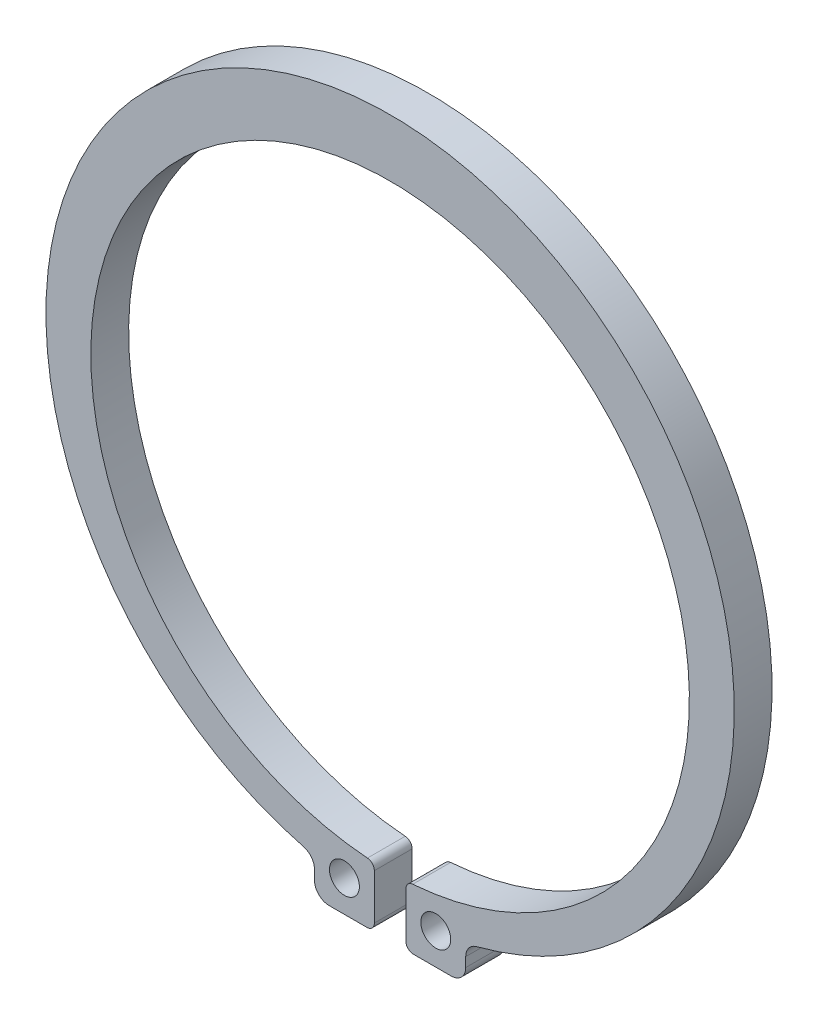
ISO-10303-21;
HEADER;
FILE_DESCRIPTION(('STEP AP214'),'2;1');
FILE_NAME('part.step','',(''),(''),'','','');
FILE_SCHEMA(('AUTOMOTIVE_DESIGN { 1 0 10303 214 1 1 1 1 }'));
ENDSEC;
DATA;
#1=APPLICATION_CONTEXT('core data for automotive mechanical design processes');
#2=APPLICATION_PROTOCOL_DEFINITION('international standard','automotive_design',2000,#1);
#3=PRODUCT_CONTEXT('',#1,'mechanical');
#4=PRODUCT('Part','Part','',(#3));
#5=PRODUCT_RELATED_PRODUCT_CATEGORY('part','',(#4));
#6=PRODUCT_DEFINITION_FORMATION('','',#4);
#7=PRODUCT_DEFINITION_CONTEXT('part definition',#1,'design');
#8=PRODUCT_DEFINITION('design','',#6,#7);
#9=PRODUCT_DEFINITION_SHAPE('','',#8);
#10=(LENGTH_UNIT() NAMED_UNIT(*) SI_UNIT(.MILLI.,.METRE.));
#11=(NAMED_UNIT(*) PLANE_ANGLE_UNIT() SI_UNIT($,.RADIAN.));
#12=(NAMED_UNIT(*) SI_UNIT($,.STERADIAN.) SOLID_ANGLE_UNIT());
#13=UNCERTAINTY_MEASURE_WITH_UNIT(LENGTH_MEASURE(1.E-05),#10,'distance_accuracy_value','');
#14=(GEOMETRIC_REPRESENTATION_CONTEXT(3) GLOBAL_UNCERTAINTY_ASSIGNED_CONTEXT((#13)) GLOBAL_UNIT_ASSIGNED_CONTEXT((#10,
#11,#12)) REPRESENTATION_CONTEXT('',''));
#15=CARTESIAN_POINT('',(0.,0.,0.));
#16=DIRECTION('',(0.,0.,1.));
#17=DIRECTION('',(1.,0.,0.));
#18=AXIS2_PLACEMENT_3D('',#15,#16,#17);
#19=CARTESIAN_POINT('',(0.,0.,1.20000000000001));
#20=DIRECTION('',(0.,0.,1.));
#21=DIRECTION('',(1.,0.,0.));
#22=AXIS2_PLACEMENT_3D('',#19,#20,#21);
#23=PLANE('',#22);
#24=DIRECTION('',(-1.,0.,0.));
#25=VECTOR('',#24,1.);
#26=CARTESIAN_POINT('',(-0.499999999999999,-11.7868329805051,1.20000000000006));
#27=LINE('',#26,#25);
#28=CARTESIAN_POINT('',(-0.737499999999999,-11.7868329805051,1.20000000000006));
#29=VERTEX_POINT('',#28);
#30=CARTESIAN_POINT('',(-1.93658536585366,-11.7868329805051,1.20000000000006));
#31=VERTEX_POINT('',#30);
#32=EDGE_CURVE('E176',#29,#31,#27,.T.);
#33=ORIENTED_EDGE('',*,*,#32,.F.);
#34=CARTESIAN_POINT('',(-0.737499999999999,-11.5493329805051,1.20000000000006));
#35=DIRECTION('',(0.,0.,1.));
#36=DIRECTION('',(1.,0.,0.));
#37=AXIS2_PLACEMENT_3D('',#34,#35,#36);
#38=CIRCLE('',#37,0.2375);
#39=CARTESIAN_POINT('',(-0.499999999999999,-11.5493329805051,1.20000000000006));
#40=VERTEX_POINT('',#39);
#41=EDGE_CURVE('E243',#29,#40,#38,.T.);
#42=ORIENTED_EDGE('',*,*,#41,.T.);
#43=DIRECTION('',(0.,-1.,0.));
#44=VECTOR('',#43,1.);
#45=CARTESIAN_POINT('',(-0.499999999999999,-9.88683298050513,1.20000000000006));
#46=LINE('',#45,#44);
#47=CARTESIAN_POINT('',(-0.499999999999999,-10.1095313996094,1.20000000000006));
#48=VERTEX_POINT('',#47);
#49=EDGE_CURVE('E190',#48,#40,#46,.T.);
#50=ORIENTED_EDGE('',*,*,#49,.F.);
#51=CARTESIAN_POINT('',(-0.737499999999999,-10.1095313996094,1.20000000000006));
#52=DIRECTION('',(0.,0.,1.));
#53=DIRECTION('',(1.,0.,0.));
#54=AXIS2_PLACEMENT_3D('',#51,#52,#53);
#55=CIRCLE('',#54,0.2375);
#56=CARTESIAN_POINT('',(-0.71951219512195,-9.87271356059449,1.20000000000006));
#57=VERTEX_POINT('',#56);
#58=EDGE_CURVE('E239',#48,#57,#55,.T.);
#59=ORIENTED_EDGE('',*,*,#58,.T.);
#60=CARTESIAN_POINT('',(0.,-0.400000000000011,1.20000000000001));
#61=DIRECTION('',(0.,0.,1.));
#62=DIRECTION('',(1.,0.,0.));
#63=AXIS2_PLACEMENT_3D('',#60,#61,#62);
#64=CIRCLE('',#63,9.5);
#65=CARTESIAN_POINT('',(0.719512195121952,-9.87271356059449,1.20000000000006));
#66=VERTEX_POINT('',#65);
#67=EDGE_CURVE('E199',#66,#57,#64,.T.);
#68=ORIENTED_EDGE('',*,*,#67,.F.);
#69=CARTESIAN_POINT('',(0.737500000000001,-10.1095313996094,1.20000000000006));
#70=DIRECTION('',(0.,0.,1.));
#71=DIRECTION('',(1.,0.,0.));
#72=AXIS2_PLACEMENT_3D('',#69,#70,#71);
#73=CIRCLE('',#72,0.2375);
#74=CARTESIAN_POINT('',(0.500000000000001,-10.1095313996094,1.20000000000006));
#75=VERTEX_POINT('',#74);
#76=EDGE_CURVE('E237',#66,#75,#73,.T.);
#77=ORIENTED_EDGE('',*,*,#76,.T.);
#78=DIRECTION('',(0.,-1.,0.));
#79=VECTOR('',#78,1.);
#80=CARTESIAN_POINT('',(0.500000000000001,-9.88683298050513,1.20000000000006));
#81=LINE('',#80,#79);
#82=CARTESIAN_POINT('',(0.500000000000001,-11.5493329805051,1.20000000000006));
#83=VERTEX_POINT('',#82);
#84=EDGE_CURVE('E187',#75,#83,#81,.T.);
#85=ORIENTED_EDGE('',*,*,#84,.T.);
#86=CARTESIAN_POINT('',(0.737500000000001,-11.5493329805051,1.20000000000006));
#87=DIRECTION('',(0.,0.,1.));
#88=DIRECTION('',(1.,0.,0.));
#89=AXIS2_PLACEMENT_3D('',#86,#87,#88);
#90=CIRCLE('',#89,0.2375);
#91=CARTESIAN_POINT('',(0.737500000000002,-11.7868329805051,1.20000000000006));
#92=VERTEX_POINT('',#91);
#93=EDGE_CURVE('E241',#83,#92,#90,.T.);
#94=ORIENTED_EDGE('',*,*,#93,.T.);
#95=DIRECTION('',(1.,0.,0.));
#96=VECTOR('',#95,1.);
#97=CARTESIAN_POINT('',(0.500000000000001,-11.7868329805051,1.20000000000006));
#98=LINE('',#97,#96);
#99=CARTESIAN_POINT('',(1.93658536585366,-11.7868329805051,1.20000000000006));
#100=VERTEX_POINT('',#99);
#101=EDGE_CURVE('E354',#92,#100,#98,.T.);
#102=ORIENTED_EDGE('',*,*,#101,.T.);
#103=CARTESIAN_POINT('',(1.93658536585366,-11.3234183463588,1.20000000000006));
#104=DIRECTION('',(0.,0.,1.));
#105=DIRECTION('',(1.,0.,0.));
#106=AXIS2_PLACEMENT_3D('',#103,#104,#105);
#107=CIRCLE('',#106,0.463414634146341);
#108=CARTESIAN_POINT('',(2.4,-11.3234183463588,1.20000000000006));
#109=VERTEX_POINT('',#108);
#110=EDGE_CURVE('E158',#100,#109,#107,.T.);
#111=ORIENTED_EDGE('',*,*,#110,.T.);
#112=DIRECTION('',(0.,1.,0.));
#113=VECTOR('',#112,1.);
#114=CARTESIAN_POINT('',(2.4,-11.7868329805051,1.20000000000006));
#115=LINE('',#114,#113);
#116=CARTESIAN_POINT('',(2.4,-11.0225607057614,1.20000000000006));
#117=VERTEX_POINT('',#116);
#118=EDGE_CURVE('E345',#109,#117,#115,.T.);
#119=ORIENTED_EDGE('',*,*,#118,.T.);
#120=CARTESIAN_POINT('',(2.86341463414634,-11.0225607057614,1.20000000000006));
#121=DIRECTION('',(0.,0.,1.));
#122=DIRECTION('',(1.,0.,0.));
#123=AXIS2_PLACEMENT_3D('',#120,#121,#122);
#124=CIRCLE('',#123,0.463414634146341);
#125=CARTESIAN_POINT('',(2.74689725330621,-10.5740333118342,1.20000000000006));
#126=VERTEX_POINT('',#125);
#127=EDGE_CURVE('E232',#117,#126,#124,.F.);
#128=ORIENTED_EDGE('',*,*,#127,.T.);
#129=CARTESIAN_POINT('',(0.,0.,1.20000000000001));
#130=DIRECTION('',(0.,0.,1.));
#131=DIRECTION('',(1.,0.,0.));
#132=AXIS2_PLACEMENT_3D('',#129,#130,#131);
#133=CIRCLE('',#132,10.925);
#134=CARTESIAN_POINT('',(-2.7468972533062,-10.5740333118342,1.20000000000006));
#135=VERTEX_POINT('',#134);
#136=EDGE_CURVE('E170',#126,#135,#133,.T.);
#137=ORIENTED_EDGE('',*,*,#136,.T.);
#138=CARTESIAN_POINT('',(-2.86341463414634,-11.0225607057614,1.20000000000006));
#139=DIRECTION('',(0.,0.,1.));
#140=DIRECTION('',(1.,0.,0.));
#141=AXIS2_PLACEMENT_3D('',#138,#139,#140);
#142=CIRCLE('',#141,0.463414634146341);
#143=CARTESIAN_POINT('',(-2.4,-11.0225607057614,1.20000000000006));
#144=VERTEX_POINT('',#143);
#145=EDGE_CURVE('E175',#135,#144,#142,.F.);
#146=ORIENTED_EDGE('',*,*,#145,.T.);
#147=DIRECTION('',(0.,1.,0.));
#148=VECTOR('',#147,1.);
#149=CARTESIAN_POINT('',(-2.4,-11.7868329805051,1.20000000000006));
#150=LINE('',#149,#148);
#151=CARTESIAN_POINT('',(-2.4,-11.3234183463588,1.20000000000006));
#152=VERTEX_POINT('',#151);
#153=EDGE_CURVE('E165',#152,#144,#150,.T.);
#154=ORIENTED_EDGE('',*,*,#153,.F.);
#155=CARTESIAN_POINT('',(-1.93658536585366,-11.3234183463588,1.20000000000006));
#156=DIRECTION('',(0.,0.,1.));
#157=DIRECTION('',(1.,0.,0.));
#158=AXIS2_PLACEMENT_3D('',#155,#156,#157);
#159=CIRCLE('',#158,0.463414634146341);
#160=EDGE_CURVE('E148',#152,#31,#159,.T.);
#161=ORIENTED_EDGE('',*,*,#160,.T.);
#162=EDGE_LOOP('',(#33,#42,#50,#59,#68,#77,#85,#94,#102,#111,#119,#128,#137,#146,#154,#161));
#163=FACE_BOUND('',#162,.T.);
#164=CARTESIAN_POINT('',(-1.44999999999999,-10.7877614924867,1.20000000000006));
#165=DIRECTION('',(0.,0.,1.));
#166=DIRECTION('',(1.,0.,0.));
#167=AXIS2_PLACEMENT_3D('',#164,#165,#166);
#168=CIRCLE('',#167,0.475);
#169=CARTESIAN_POINT('',(-0.974999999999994,-10.7877614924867,1.20000000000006));
#170=VERTEX_POINT('',#169);
#171=EDGE_CURVE('E342',#170,#170,#168,.T.);
#172=ORIENTED_EDGE('',*,*,#171,.F.);
#173=EDGE_LOOP('',(#172));
#174=FACE_BOUND('',#173,.T.);
#175=CARTESIAN_POINT('',(1.45,-10.7877614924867,1.20000000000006));
#176=DIRECTION('',(0.,0.,-1.));
#177=DIRECTION('',(-1.,0.,0.));
#178=AXIS2_PLACEMENT_3D('',#175,#176,#177);
#179=CIRCLE('',#178,0.475);
#180=CARTESIAN_POINT('',(0.974999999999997,-10.7877614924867,1.20000000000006));
#181=VERTEX_POINT('',#180);
#182=EDGE_CURVE('E348',#181,#181,#179,.T.);
#183=ORIENTED_EDGE('',*,*,#182,.T.);
#184=EDGE_LOOP('',(#183));
#185=FACE_BOUND('',#184,.T.);
#186=ADVANCED_FACE('F34',(#163,#174,#185),#23,.T.);
#187=CARTESIAN_POINT('',(0.,0.,0.));
#188=DIRECTION('',(0.,0.,1.));
#189=DIRECTION('',(1.,0.,0.));
#190=AXIS2_PLACEMENT_3D('',#187,#188,#189);
#191=PLANE('',#190);
#192=DIRECTION('',(0.,-1.,0.));
#193=VECTOR('',#192,1.);
#194=CARTESIAN_POINT('',(-0.499999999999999,-9.88683298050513,0.));
#195=LINE('',#194,#193);
#196=CARTESIAN_POINT('',(-0.499999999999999,-10.1095313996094,0.));
#197=VERTEX_POINT('',#196);
#198=CARTESIAN_POINT('',(-0.499999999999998,-11.5493329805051,0.));
#199=VERTEX_POINT('',#198);
#200=EDGE_CURVE('E196',#197,#199,#195,.T.);
#201=ORIENTED_EDGE('',*,*,#200,.T.);
#202=CARTESIAN_POINT('',(-0.737499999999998,-11.5493329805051,0.));
#203=DIRECTION('',(0.,0.,1.));
#204=DIRECTION('',(1.,0.,0.));
#205=AXIS2_PLACEMENT_3D('',#202,#203,#204);
#206=CIRCLE('',#205,0.2375);
#207=CARTESIAN_POINT('',(-0.737499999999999,-11.7868329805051,0.));
#208=VERTEX_POINT('',#207);
#209=EDGE_CURVE('E255',#199,#208,#206,.F.);
#210=ORIENTED_EDGE('',*,*,#209,.T.);
#211=DIRECTION('',(-1.,0.,0.));
#212=VECTOR('',#211,1.);
#213=CARTESIAN_POINT('',(-0.499999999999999,-11.7868329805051,0.));
#214=LINE('',#213,#212);
#215=CARTESIAN_POINT('',(-1.93658536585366,-11.7868329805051,0.));
#216=VERTEX_POINT('',#215);
#217=EDGE_CURVE('E185',#208,#216,#214,.T.);
#218=ORIENTED_EDGE('',*,*,#217,.T.);
#219=CARTESIAN_POINT('',(-1.93658536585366,-11.3234183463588,0.));
#220=DIRECTION('',(0.,0.,1.));
#221=DIRECTION('',(1.,0.,0.));
#222=AXIS2_PLACEMENT_3D('',#219,#220,#221);
#223=CIRCLE('',#222,0.463414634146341);
#224=CARTESIAN_POINT('',(-2.4,-11.3234183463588,0.));
#225=VERTEX_POINT('',#224);
#226=EDGE_CURVE('E218',#216,#225,#223,.F.);
#227=ORIENTED_EDGE('',*,*,#226,.T.);
#228=DIRECTION('',(0.,1.,0.));
#229=VECTOR('',#228,1.);
#230=CARTESIAN_POINT('',(-2.4,-11.7868329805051,0.));
#231=LINE('',#230,#229);
#232=CARTESIAN_POINT('',(-2.4,-11.0225607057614,0.));
#233=VERTEX_POINT('',#232);
#234=EDGE_CURVE('E168',#225,#233,#231,.T.);
#235=ORIENTED_EDGE('',*,*,#234,.T.);
#236=CARTESIAN_POINT('',(-2.86341463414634,-11.0225607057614,0.));
#237=DIRECTION('',(0.,0.,1.));
#238=DIRECTION('',(1.,0.,0.));
#239=AXIS2_PLACEMENT_3D('',#236,#237,#238);
#240=CIRCLE('',#239,0.463414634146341);
#241=CARTESIAN_POINT('',(-2.7468972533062,-10.5740333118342,0.));
#242=VERTEX_POINT('',#241);
#243=EDGE_CURVE('E227',#233,#242,#240,.T.);
#244=ORIENTED_EDGE('',*,*,#243,.T.);
#245=CARTESIAN_POINT('',(0.,0.,0.));
#246=DIRECTION('',(0.,0.,1.));
#247=DIRECTION('',(1.,0.,0.));
#248=AXIS2_PLACEMENT_3D('',#245,#246,#247);
#249=CIRCLE('',#248,10.925);
#250=CARTESIAN_POINT('',(2.74689725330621,-10.5740333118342,0.));
#251=VERTEX_POINT('',#250);
#252=EDGE_CURVE('E203',#251,#242,#249,.T.);
#253=ORIENTED_EDGE('',*,*,#252,.F.);
#254=CARTESIAN_POINT('',(2.86341463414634,-11.0225607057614,0.));
#255=DIRECTION('',(0.,0.,1.));
#256=DIRECTION('',(1.,0.,0.));
#257=AXIS2_PLACEMENT_3D('',#254,#255,#256);
#258=CIRCLE('',#257,0.463414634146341);
#259=CARTESIAN_POINT('',(2.4,-11.0225607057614,0.));
#260=VERTEX_POINT('',#259);
#261=EDGE_CURVE('E230',#251,#260,#258,.T.);
#262=ORIENTED_EDGE('',*,*,#261,.T.);
#263=DIRECTION('',(0.,1.,0.));
#264=VECTOR('',#263,1.);
#265=CARTESIAN_POINT('',(2.4,-11.7868329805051,0.));
#266=LINE('',#265,#264);
#267=CARTESIAN_POINT('',(2.4,-11.3234183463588,0.));
#268=VERTEX_POINT('',#267);
#269=EDGE_CURVE('E180',#268,#260,#266,.T.);
#270=ORIENTED_EDGE('',*,*,#269,.F.);
#271=CARTESIAN_POINT('',(1.93658536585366,-11.3234183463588,0.));
#272=DIRECTION('',(0.,0.,1.));
#273=DIRECTION('',(1.,0.,0.));
#274=AXIS2_PLACEMENT_3D('',#271,#272,#273);
#275=CIRCLE('',#274,0.463414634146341);
#276=CARTESIAN_POINT('',(1.93658536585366,-11.7868329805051,0.));
#277=VERTEX_POINT('',#276);
#278=EDGE_CURVE('E215',#268,#277,#275,.F.);
#279=ORIENTED_EDGE('',*,*,#278,.T.);
#280=DIRECTION('',(1.,0.,0.));
#281=VECTOR('',#280,1.);
#282=CARTESIAN_POINT('',(0.500000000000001,-11.7868329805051,0.));
#283=LINE('',#282,#281);
#284=CARTESIAN_POINT('',(0.737500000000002,-11.7868329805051,0.));
#285=VERTEX_POINT('',#284);
#286=EDGE_CURVE('E177',#285,#277,#283,.T.);
#287=ORIENTED_EDGE('',*,*,#286,.F.);
#288=CARTESIAN_POINT('',(0.737500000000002,-11.5493329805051,0.));
#289=DIRECTION('',(0.,0.,1.));
#290=DIRECTION('',(1.,0.,0.));
#291=AXIS2_PLACEMENT_3D('',#288,#289,#290);
#292=CIRCLE('',#291,0.2375);
#293=CARTESIAN_POINT('',(0.500000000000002,-11.5493329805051,0.));
#294=VERTEX_POINT('',#293);
#295=EDGE_CURVE('E253',#285,#294,#292,.F.);
#296=ORIENTED_EDGE('',*,*,#295,.T.);
#297=DIRECTION('',(0.,-1.,0.));
#298=VECTOR('',#297,1.);
#299=CARTESIAN_POINT('',(0.500000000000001,-9.88683298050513,0.));
#300=LINE('',#299,#298);
#301=CARTESIAN_POINT('',(0.500000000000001,-10.1095313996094,0.));
#302=VERTEX_POINT('',#301);
#303=EDGE_CURVE('E193',#302,#294,#300,.T.);
#304=ORIENTED_EDGE('',*,*,#303,.F.);
#305=CARTESIAN_POINT('',(0.737500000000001,-10.1095313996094,0.));
#306=DIRECTION('',(0.,0.,1.));
#307=DIRECTION('',(1.,0.,0.));
#308=AXIS2_PLACEMENT_3D('',#305,#306,#307);
#309=CIRCLE('',#308,0.2375);
#310=CARTESIAN_POINT('',(0.719512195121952,-9.87271356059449,0.));
#311=VERTEX_POINT('',#310);
#312=EDGE_CURVE('E54',#302,#311,#309,.F.);
#313=ORIENTED_EDGE('',*,*,#312,.T.);
#314=CARTESIAN_POINT('',(0.,-0.400000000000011,0.));
#315=DIRECTION('',(0.,0.,1.));
#316=DIRECTION('',(1.,0.,0.));
#317=AXIS2_PLACEMENT_3D('',#314,#315,#316);
#318=CIRCLE('',#317,9.5);
#319=CARTESIAN_POINT('',(-0.71951219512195,-9.87271356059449,0.));
#320=VERTEX_POINT('',#319);
#321=EDGE_CURVE('E201',#311,#320,#318,.T.);
#322=ORIENTED_EDGE('',*,*,#321,.T.);
#323=CARTESIAN_POINT('',(-0.737499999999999,-10.1095313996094,0.));
#324=DIRECTION('',(0.,0.,1.));
#325=DIRECTION('',(1.,0.,0.));
#326=AXIS2_PLACEMENT_3D('',#323,#324,#325);
#327=CIRCLE('',#326,0.2375);
#328=EDGE_CURVE('E251',#320,#197,#327,.F.);
#329=ORIENTED_EDGE('',*,*,#328,.T.);
#330=EDGE_LOOP('',(#201,#210,#218,#227,#235,#244,#253,#262,#270,#279,#287,#296,#304,#313,#322,#329));
#331=FACE_BOUND('',#330,.T.);
#332=CARTESIAN_POINT('',(-1.44999999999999,-10.7877614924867,0.));
#333=DIRECTION('',(0.,0.,1.));
#334=DIRECTION('',(1.,0.,0.));
#335=AXIS2_PLACEMENT_3D('',#332,#333,#334);
#336=CIRCLE('',#335,0.475);
#337=CARTESIAN_POINT('',(-0.974999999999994,-10.7877614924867,0.));
#338=VERTEX_POINT('',#337);
#339=EDGE_CURVE('E339',#338,#338,#336,.T.);
#340=ORIENTED_EDGE('',*,*,#339,.T.);
#341=EDGE_LOOP('',(#340));
#342=FACE_BOUND('',#341,.T.);
#343=CARTESIAN_POINT('',(1.45,-10.7877614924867,0.));
#344=DIRECTION('',(0.,0.,-1.));
#345=DIRECTION('',(-1.,0.,0.));
#346=AXIS2_PLACEMENT_3D('',#343,#344,#345);
#347=CIRCLE('',#346,0.475);
#348=CARTESIAN_POINT('',(0.974999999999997,-10.7877614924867,0.));
#349=VERTEX_POINT('',#348);
#350=EDGE_CURVE('E343',#349,#349,#347,.T.);
#351=ORIENTED_EDGE('',*,*,#350,.F.);
#352=EDGE_LOOP('',(#351));
#353=FACE_BOUND('',#352,.T.);
#354=ADVANCED_FACE('F279',(#331,#342,#353),#191,.F.);
#355=CARTESIAN_POINT('',(0.,0.,1.20000000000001));
#356=DIRECTION('',(0.,0.,-1.));
#357=DIRECTION('',(-1.,0.,0.));
#358=AXIS2_PLACEMENT_3D('',#355,#356,#357);
#359=CYLINDRICAL_SURFACE('',#358,10.925);
#360=ORIENTED_EDGE('',*,*,#252,.T.);
#361=DIRECTION('',(0.,0.,-1.));
#362=VECTOR('',#361,1.);
#363=CARTESIAN_POINT('',(-2.74689725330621,-10.5740333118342,1.20000000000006));
#364=LINE('',#363,#362);
#365=EDGE_CURVE('E211',#242,#135,#364,.F.);
#366=ORIENTED_EDGE('',*,*,#365,.T.);
#367=ORIENTED_EDGE('',*,*,#136,.F.);
#368=DIRECTION('',(0.,0.,-1.));
#369=VECTOR('',#368,1.);
#370=CARTESIAN_POINT('',(2.74689725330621,-10.5740333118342,1.20000000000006));
#371=LINE('',#370,#369);
#372=EDGE_CURVE('E208',#126,#251,#371,.T.);
#373=ORIENTED_EDGE('',*,*,#372,.T.);
#374=EDGE_LOOP('',(#360,#366,#367,#373));
#375=FACE_BOUND('',#374,.T.);
#376=ADVANCED_FACE('F36',(#375),#359,.T.);
#377=CARTESIAN_POINT('',(0.,-0.400000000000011,0.));
#378=DIRECTION('',(0.,0.,1.));
#379=DIRECTION('',(1.,0.,0.));
#380=AXIS2_PLACEMENT_3D('',#377,#378,#379);
#381=CYLINDRICAL_SURFACE('',#380,9.5);
#382=ORIENTED_EDGE('',*,*,#67,.T.);
#383=DIRECTION('',(0.,0.,1.));
#384=VECTOR('',#383,1.);
#385=CARTESIAN_POINT('',(-0.71951219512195,-9.87271356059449,0.));
#386=LINE('',#385,#384);
#387=EDGE_CURVE('E11',#57,#320,#386,.F.);
#388=ORIENTED_EDGE('',*,*,#387,.T.);
#389=ORIENTED_EDGE('',*,*,#321,.F.);
#390=DIRECTION('',(0.,0.,1.));
#391=VECTOR('',#390,1.);
#392=CARTESIAN_POINT('',(0.719512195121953,-9.87271356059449,0.));
#393=LINE('',#392,#391);
#394=EDGE_CURVE('E42',#311,#66,#393,.T.);
#395=ORIENTED_EDGE('',*,*,#394,.T.);
#396=EDGE_LOOP('',(#382,#388,#389,#395));
#397=FACE_BOUND('',#396,.T.);
#398=ADVANCED_FACE('F266',(#397),#381,.F.);
#399=CARTESIAN_POINT('',(-0.499999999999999,-9.88683298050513,0.));
#400=DIRECTION('',(-1.,0.,0.));
#401=DIRECTION('',(0.,-1.,0.));
#402=AXIS2_PLACEMENT_3D('',#399,#400,#401);
#403=PLANE('',#402);
#404=ORIENTED_EDGE('',*,*,#49,.T.);
#405=DIRECTION('',(0.,0.,1.));
#406=VECTOR('',#405,1.);
#407=CARTESIAN_POINT('',(-0.499999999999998,-11.5493329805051,0.));
#408=LINE('',#407,#406);
#409=EDGE_CURVE('E248',#40,#199,#408,.F.);
#410=ORIENTED_EDGE('',*,*,#409,.T.);
#411=ORIENTED_EDGE('',*,*,#200,.F.);
#412=DIRECTION('',(0.,0.,1.));
#413=VECTOR('',#412,1.);
#414=CARTESIAN_POINT('',(-0.499999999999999,-10.1095313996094,0.));
#415=LINE('',#414,#413);
#416=EDGE_CURVE('E245',#197,#48,#415,.T.);
#417=ORIENTED_EDGE('',*,*,#416,.T.);
#418=EDGE_LOOP('',(#404,#410,#411,#417));
#419=FACE_BOUND('',#418,.T.);
#420=ADVANCED_FACE('F276',(#419),#403,.F.);
#421=CARTESIAN_POINT('',(0.500000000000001,-9.88683298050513,0.));
#422=DIRECTION('',(-1.,0.,0.));
#423=DIRECTION('',(0.,-1.,0.));
#424=AXIS2_PLACEMENT_3D('',#421,#422,#423);
#425=PLANE('',#424);
#426=ORIENTED_EDGE('',*,*,#303,.T.);
#427=DIRECTION('',(0.,0.,1.));
#428=VECTOR('',#427,1.);
#429=CARTESIAN_POINT('',(0.500000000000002,-11.5493329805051,0.));
#430=LINE('',#429,#428);
#431=EDGE_CURVE('E259',#294,#83,#430,.T.);
#432=ORIENTED_EDGE('',*,*,#431,.T.);
#433=ORIENTED_EDGE('',*,*,#84,.F.);
#434=DIRECTION('',(0.,0.,-1.));
#435=VECTOR('',#434,1.);
#436=CARTESIAN_POINT('',(0.500000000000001,-10.1095313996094,0.));
#437=LINE('',#436,#435);
#438=EDGE_CURVE('E257',#75,#302,#437,.T.);
#439=ORIENTED_EDGE('',*,*,#438,.T.);
#440=EDGE_LOOP('',(#426,#432,#433,#439));
#441=FACE_BOUND('',#440,.T.);
#442=ADVANCED_FACE('F314',(#441),#425,.T.);
#443=CARTESIAN_POINT('',(-2.4,-11.7868329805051,0.));
#444=DIRECTION('',(1.,0.,0.));
#445=DIRECTION('',(0.,1.,0.));
#446=AXIS2_PLACEMENT_3D('',#443,#444,#445);
#447=PLANE('',#446);
#448=ORIENTED_EDGE('',*,*,#153,.T.);
#449=DIRECTION('',(0.,0.,1.));
#450=VECTOR('',#449,1.);
#451=CARTESIAN_POINT('',(-2.4,-11.0225607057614,0.));
#452=LINE('',#451,#450);
#453=EDGE_CURVE('E169',#144,#233,#452,.F.);
#454=ORIENTED_EDGE('',*,*,#453,.T.);
#455=ORIENTED_EDGE('',*,*,#234,.F.);
#456=DIRECTION('',(0.,0.,1.));
#457=VECTOR('',#456,1.);
#458=CARTESIAN_POINT('',(-2.4,-11.3234183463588,0.));
#459=LINE('',#458,#457);
#460=EDGE_CURVE('E152',#225,#152,#459,.T.);
#461=ORIENTED_EDGE('',*,*,#460,.T.);
#462=EDGE_LOOP('',(#448,#454,#455,#461));
#463=FACE_BOUND('',#462,.T.);
#464=ADVANCED_FACE('F163',(#463),#447,.F.);
#465=CARTESIAN_POINT('',(-0.499999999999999,-11.7868329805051,0.));
#466=DIRECTION('',(0.,1.,0.));
#467=DIRECTION('',(-1.,0.,0.));
#468=AXIS2_PLACEMENT_3D('',#465,#466,#467);
#469=PLANE('',#468);
#470=ORIENTED_EDGE('',*,*,#217,.F.);
#471=DIRECTION('',(0.,0.,1.));
#472=VECTOR('',#471,1.);
#473=CARTESIAN_POINT('',(-0.737499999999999,-11.7868329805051,0.));
#474=LINE('',#473,#472);
#475=EDGE_CURVE('E234',#208,#29,#474,.T.);
#476=ORIENTED_EDGE('',*,*,#475,.T.);
#477=ORIENTED_EDGE('',*,*,#32,.T.);
#478=DIRECTION('',(0.,0.,1.));
#479=VECTOR('',#478,1.);
#480=CARTESIAN_POINT('',(-1.93658536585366,-11.7868329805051,0.));
#481=LINE('',#480,#479);
#482=EDGE_CURVE('E154',#31,#216,#481,.F.);
#483=ORIENTED_EDGE('',*,*,#482,.T.);
#484=EDGE_LOOP('',(#470,#476,#477,#483));
#485=FACE_BOUND('',#484,.T.);
#486=ADVANCED_FACE('F286',(#485),#469,.F.);
#487=CARTESIAN_POINT('',(2.4,-11.7868329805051,0.));
#488=DIRECTION('',(1.,0.,0.));
#489=DIRECTION('',(0.,1.,0.));
#490=AXIS2_PLACEMENT_3D('',#487,#488,#489);
#491=PLANE('',#490);
#492=ORIENTED_EDGE('',*,*,#118,.F.);
#493=DIRECTION('',(0.,0.,1.));
#494=VECTOR('',#493,1.);
#495=CARTESIAN_POINT('',(2.4,-11.3234183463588,0.));
#496=LINE('',#495,#494);
#497=EDGE_CURVE('E225',#109,#268,#496,.F.);
#498=ORIENTED_EDGE('',*,*,#497,.T.);
#499=ORIENTED_EDGE('',*,*,#269,.T.);
#500=DIRECTION('',(0.,0.,-1.));
#501=VECTOR('',#500,1.);
#502=CARTESIAN_POINT('',(2.4,-11.0225607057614,0.));
#503=LINE('',#502,#501);
#504=EDGE_CURVE('E223',#260,#117,#503,.F.);
#505=ORIENTED_EDGE('',*,*,#504,.T.);
#506=EDGE_LOOP('',(#492,#498,#499,#505));
#507=FACE_BOUND('',#506,.T.);
#508=ADVANCED_FACE('F324',(#507),#491,.T.);
#509=CARTESIAN_POINT('',(0.500000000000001,-11.7868329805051,0.));
#510=DIRECTION('',(0.,-1.,0.));
#511=DIRECTION('',(1.,0.,0.));
#512=AXIS2_PLACEMENT_3D('',#509,#510,#511);
#513=PLANE('',#512);
#514=ORIENTED_EDGE('',*,*,#101,.F.);
#515=DIRECTION('',(0.,0.,1.));
#516=VECTOR('',#515,1.);
#517=CARTESIAN_POINT('',(0.737500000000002,-11.7868329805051,0.));
#518=LINE('',#517,#516);
#519=EDGE_CURVE('E262',#92,#285,#518,.F.);
#520=ORIENTED_EDGE('',*,*,#519,.T.);
#521=ORIENTED_EDGE('',*,*,#286,.T.);
#522=DIRECTION('',(0.,0.,1.));
#523=VECTOR('',#522,1.);
#524=CARTESIAN_POINT('',(1.93658536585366,-11.7868329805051,0.));
#525=LINE('',#524,#523);
#526=EDGE_CURVE('E220',#277,#100,#525,.T.);
#527=ORIENTED_EDGE('',*,*,#526,.T.);
#528=EDGE_LOOP('',(#514,#520,#521,#527));
#529=FACE_BOUND('',#528,.T.);
#530=ADVANCED_FACE('F327',(#529),#513,.T.);
#531=CARTESIAN_POINT('',(-1.44999999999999,-10.7877614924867,0.));
#532=DIRECTION('',(0.,0.,1.));
#533=DIRECTION('',(1.,0.,0.));
#534=AXIS2_PLACEMENT_3D('',#531,#532,#533);
#535=CYLINDRICAL_SURFACE('',#534,0.475);
#536=ORIENTED_EDGE('',*,*,#339,.F.);
#537=EDGE_LOOP('',(#536));
#538=FACE_BOUND('',#537,.T.);
#539=ORIENTED_EDGE('',*,*,#171,.T.);
#540=EDGE_LOOP('',(#539));
#541=FACE_BOUND('',#540,.T.);
#542=ADVANCED_FACE('F303',(#538,#541),#535,.F.);
#543=CARTESIAN_POINT('',(1.45,-10.7877614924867,0.));
#544=DIRECTION('',(0.,0.,1.));
#545=DIRECTION('',(1.,0.,0.));
#546=AXIS2_PLACEMENT_3D('',#543,#544,#545);
#547=CYLINDRICAL_SURFACE('',#546,0.475);
#548=ORIENTED_EDGE('',*,*,#350,.T.);
#549=EDGE_LOOP('',(#548));
#550=FACE_BOUND('',#549,.T.);
#551=ORIENTED_EDGE('',*,*,#182,.F.);
#552=EDGE_LOOP('',(#551));
#553=FACE_BOUND('',#552,.T.);
#554=ADVANCED_FACE('F295',(#550,#553),#547,.F.);
#555=CARTESIAN_POINT('',(-2.86341463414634,-11.0225607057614,1.20000000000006));
#556=DIRECTION('',(0.,0.,-1.));
#557=DIRECTION('',(-1.,0.,0.));
#558=AXIS2_PLACEMENT_3D('',#555,#556,#557);
#559=CYLINDRICAL_SURFACE('',#558,0.463414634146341);
#560=ORIENTED_EDGE('',*,*,#145,.F.);
#561=ORIENTED_EDGE('',*,*,#365,.F.);
#562=ORIENTED_EDGE('',*,*,#243,.F.);
#563=ORIENTED_EDGE('',*,*,#453,.F.);
#564=EDGE_LOOP('',(#560,#561,#562,#563));
#565=FACE_BOUND('',#564,.T.);
#566=ADVANCED_FACE('F293',(#565),#559,.F.);
#567=CARTESIAN_POINT('',(-1.93658536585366,-11.3234183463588,0.));
#568=DIRECTION('',(0.,0.,1.));
#569=DIRECTION('',(1.,0.,0.));
#570=AXIS2_PLACEMENT_3D('',#567,#568,#569);
#571=CYLINDRICAL_SURFACE('',#570,0.463414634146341);
#572=ORIENTED_EDGE('',*,*,#226,.F.);
#573=ORIENTED_EDGE('',*,*,#482,.F.);
#574=ORIENTED_EDGE('',*,*,#160,.F.);
#575=ORIENTED_EDGE('',*,*,#460,.F.);
#576=EDGE_LOOP('',(#572,#573,#574,#575));
#577=FACE_BOUND('',#576,.T.);
#578=ADVANCED_FACE('F151',(#577),#571,.T.);
#579=CARTESIAN_POINT('',(1.93658536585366,-11.3234183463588,0.));
#580=DIRECTION('',(0.,0.,1.));
#581=DIRECTION('',(1.,0.,0.));
#582=AXIS2_PLACEMENT_3D('',#579,#580,#581);
#583=CYLINDRICAL_SURFACE('',#582,0.463414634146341);
#584=ORIENTED_EDGE('',*,*,#278,.F.);
#585=ORIENTED_EDGE('',*,*,#497,.F.);
#586=ORIENTED_EDGE('',*,*,#110,.F.);
#587=ORIENTED_EDGE('',*,*,#526,.F.);
#588=EDGE_LOOP('',(#584,#585,#586,#587));
#589=FACE_BOUND('',#588,.T.);
#590=ADVANCED_FACE('F301',(#589),#583,.T.);
#591=CARTESIAN_POINT('',(2.86341463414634,-11.0225607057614,1.20000000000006));
#592=DIRECTION('',(0.,0.,-1.));
#593=DIRECTION('',(-1.,0.,0.));
#594=AXIS2_PLACEMENT_3D('',#591,#592,#593);
#595=CYLINDRICAL_SURFACE('',#594,0.463414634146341);
#596=ORIENTED_EDGE('',*,*,#127,.F.);
#597=ORIENTED_EDGE('',*,*,#504,.F.);
#598=ORIENTED_EDGE('',*,*,#261,.F.);
#599=ORIENTED_EDGE('',*,*,#372,.F.);
#600=EDGE_LOOP('',(#596,#597,#598,#599));
#601=FACE_BOUND('',#600,.T.);
#602=ADVANCED_FACE('F363',(#601),#595,.F.);
#603=CARTESIAN_POINT('',(-0.737499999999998,-11.5493329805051,0.));
#604=DIRECTION('',(0.,0.,1.));
#605=DIRECTION('',(1.,0.,0.));
#606=AXIS2_PLACEMENT_3D('',#603,#604,#605);
#607=CYLINDRICAL_SURFACE('',#606,0.2375);
#608=ORIENTED_EDGE('',*,*,#209,.F.);
#609=ORIENTED_EDGE('',*,*,#409,.F.);
#610=ORIENTED_EDGE('',*,*,#41,.F.);
#611=ORIENTED_EDGE('',*,*,#475,.F.);
#612=EDGE_LOOP('',(#608,#609,#610,#611));
#613=FACE_BOUND('',#612,.T.);
#614=ADVANCED_FACE('F284',(#613),#607,.T.);
#615=CARTESIAN_POINT('',(0.737500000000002,-11.5493329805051,0.));
#616=DIRECTION('',(0.,0.,1.));
#617=DIRECTION('',(1.,0.,0.));
#618=AXIS2_PLACEMENT_3D('',#615,#616,#617);
#619=CYLINDRICAL_SURFACE('',#618,0.2375);
#620=ORIENTED_EDGE('',*,*,#295,.F.);
#621=ORIENTED_EDGE('',*,*,#519,.F.);
#622=ORIENTED_EDGE('',*,*,#93,.F.);
#623=ORIENTED_EDGE('',*,*,#431,.F.);
#624=EDGE_LOOP('',(#620,#621,#622,#623));
#625=FACE_BOUND('',#624,.T.);
#626=ADVANCED_FACE('F372',(#625),#619,.T.);
#627=CARTESIAN_POINT('',(-0.737499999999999,-10.1095313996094,0.));
#628=DIRECTION('',(0.,0.,1.));
#629=DIRECTION('',(1.,0.,0.));
#630=AXIS2_PLACEMENT_3D('',#627,#628,#629);
#631=CYLINDRICAL_SURFACE('',#630,0.2375);
#632=ORIENTED_EDGE('',*,*,#328,.F.);
#633=ORIENTED_EDGE('',*,*,#387,.F.);
#634=ORIENTED_EDGE('',*,*,#58,.F.);
#635=ORIENTED_EDGE('',*,*,#416,.F.);
#636=EDGE_LOOP('',(#632,#633,#634,#635));
#637=FACE_BOUND('',#636,.T.);
#638=ADVANCED_FACE('F273',(#637),#631,.T.);
#639=CARTESIAN_POINT('',(0.737500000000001,-10.1095313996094,0.));
#640=DIRECTION('',(0.,0.,1.));
#641=DIRECTION('',(1.,0.,0.));
#642=AXIS2_PLACEMENT_3D('',#639,#640,#641);
#643=CYLINDRICAL_SURFACE('',#642,0.2375);
#644=ORIENTED_EDGE('',*,*,#312,.F.);
#645=ORIENTED_EDGE('',*,*,#438,.F.);
#646=ORIENTED_EDGE('',*,*,#76,.F.);
#647=ORIENTED_EDGE('',*,*,#394,.F.);
#648=EDGE_LOOP('',(#644,#645,#646,#647));
#649=FACE_BOUND('',#648,.T.);
#650=ADVANCED_FACE('F375',(#649),#643,.T.);
#651=CLOSED_SHELL('',(#186,#354,#376,#398,#420,#442,#464,#486,#508,#530,#542,#554,#566,#578,
#590,#602,#614,#626,#638,#650));
#652=MANIFOLD_SOLID_BREP('B2',#651);
#653=ADVANCED_BREP_SHAPE_REPRESENTATION('',(#18,#652),#14);
#654=SHAPE_DEFINITION_REPRESENTATION(#9,#653);
ENDSEC;
END-ISO-10303-21;
